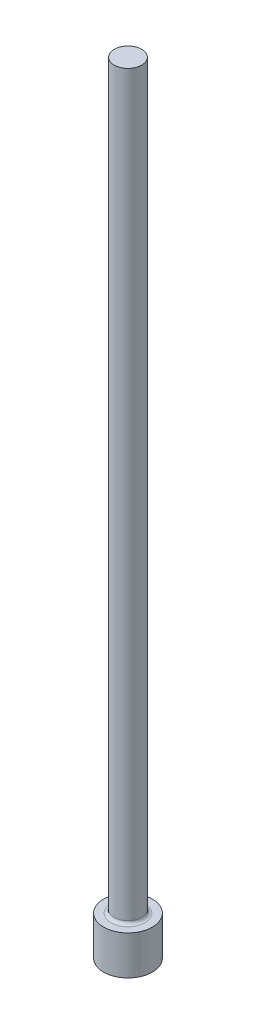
ISO-10303-21;
HEADER;
FILE_DESCRIPTION(('STEP AP214'),'2;1');
FILE_NAME('part.step','',(''),(''),'','','');
FILE_SCHEMA(('AUTOMOTIVE_DESIGN { 1 0 10303 214 1 1 1 1 }'));
ENDSEC;
DATA;
#1=APPLICATION_CONTEXT('core data for automotive mechanical design processes');
#2=APPLICATION_PROTOCOL_DEFINITION('international standard','automotive_design',2000,#1);
#3=PRODUCT_CONTEXT('',#1,'mechanical');
#4=PRODUCT('Part','Part','',(#3));
#5=PRODUCT_RELATED_PRODUCT_CATEGORY('part','',(#4));
#6=PRODUCT_DEFINITION_FORMATION('','',#4);
#7=PRODUCT_DEFINITION_CONTEXT('part definition',#1,'design');
#8=PRODUCT_DEFINITION('design','',#6,#7);
#9=PRODUCT_DEFINITION_SHAPE('','',#8);
#10=(LENGTH_UNIT() NAMED_UNIT(*) SI_UNIT(.MILLI.,.METRE.));
#11=(NAMED_UNIT(*) PLANE_ANGLE_UNIT() SI_UNIT($,.RADIAN.));
#12=(NAMED_UNIT(*) SI_UNIT($,.STERADIAN.) SOLID_ANGLE_UNIT());
#13=UNCERTAINTY_MEASURE_WITH_UNIT(LENGTH_MEASURE(1.E-05),#10,'distance_accuracy_value','');
#14=(GEOMETRIC_REPRESENTATION_CONTEXT(3) GLOBAL_UNCERTAINTY_ASSIGNED_CONTEXT((#13)) GLOBAL_UNIT_ASSIGNED_CONTEXT((#10,
#11,#12)) REPRESENTATION_CONTEXT('',''));
#15=CARTESIAN_POINT('',(0.,0.,0.));
#16=DIRECTION('',(0.,0.,1.));
#17=DIRECTION('',(1.,0.,0.));
#18=AXIS2_PLACEMENT_3D('',#15,#16,#17);
#19=CARTESIAN_POINT('',(0.,63.5,0.));
#20=DIRECTION('',(0.,-1.,0.));
#21=DIRECTION('',(0.,0.,-1.));
#22=AXIS2_PLACEMENT_3D('',#19,#20,#21);
#23=PLANE('',#22);
#24=CARTESIAN_POINT('',(0.,63.5,0.));
#25=DIRECTION('',(0.,1.,0.));
#26=DIRECTION('',(0.,0.,1.));
#27=AXIS2_PLACEMENT_3D('',#24,#25,#26);
#28=CIRCLE('',#27,1.1176);
#29=CARTESIAN_POINT('',(0.,63.5,1.1176));
#30=VERTEX_POINT('',#29);
#31=EDGE_CURVE('E10',#30,#30,#28,.T.);
#32=ORIENTED_EDGE('',*,*,#31,.T.);
#33=EDGE_LOOP('',(#32));
#34=FACE_BOUND('',#33,.T.);
#35=ADVANCED_FACE('F30',(#34),#23,.F.);
#36=CARTESIAN_POINT('',(0.,0.,0.));
#37=DIRECTION('',(0.,1.,0.));
#38=DIRECTION('',(0.,0.,1.));
#39=AXIS2_PLACEMENT_3D('',#36,#37,#38);
#40=CYLINDRICAL_SURFACE('',#39,1.1176);
#41=ORIENTED_EDGE('',*,*,#31,.F.);
#42=EDGE_LOOP('',(#41));
#43=FACE_BOUND('',#42,.T.);
#44=CARTESIAN_POINT('',(0.,3.429,0.));
#45=DIRECTION('',(0.,1.,0.));
#46=DIRECTION('',(0.,0.,1.));
#47=AXIS2_PLACEMENT_3D('',#44,#45,#46);
#48=CIRCLE('',#47,1.1176);
#49=CARTESIAN_POINT('',(0.,3.429,1.1176));
#50=VERTEX_POINT('',#49);
#51=EDGE_CURVE('E36',#50,#50,#48,.T.);
#52=ORIENTED_EDGE('',*,*,#51,.T.);
#53=EDGE_LOOP('',(#52));
#54=FACE_BOUND('',#53,.T.);
#55=ADVANCED_FACE('F65',(#43,#54),#40,.T.);
#56=CARTESIAN_POINT('',(0.,3.429,0.));
#57=DIRECTION('',(0.,1.,0.));
#58=DIRECTION('',(0.,0.,1.));
#59=AXIS2_PLACEMENT_3D('',#56,#57,#58);
#60=TOROIDAL_SURFACE('',#59,1.3716,0.254);
#61=ORIENTED_EDGE('',*,*,#51,.F.);
#62=EDGE_LOOP('',(#61));
#63=FACE_BOUND('',#62,.T.);
#64=CARTESIAN_POINT('',(0.,3.175,0.));
#65=DIRECTION('',(0.,1.,0.));
#66=DIRECTION('',(0.,0.,1.));
#67=AXIS2_PLACEMENT_3D('',#64,#65,#66);
#68=CIRCLE('',#67,1.3716);
#69=CARTESIAN_POINT('',(0.,3.175,1.3716));
#70=VERTEX_POINT('',#69);
#71=EDGE_CURVE('E40',#70,#70,#68,.T.);
#72=ORIENTED_EDGE('',*,*,#71,.T.);
#73=EDGE_LOOP('',(#72));
#74=FACE_BOUND('',#73,.T.);
#75=ADVANCED_FACE('F69',(#63,#74),#60,.F.);
#76=CARTESIAN_POINT('',(1.9812,3.175,0.));
#77=DIRECTION('',(0.,-1.,0.));
#78=DIRECTION('',(0.,0.,-1.));
#79=AXIS2_PLACEMENT_3D('',#76,#77,#78);
#80=PLANE('',#79);
#81=ORIENTED_EDGE('',*,*,#71,.F.);
#82=EDGE_LOOP('',(#81));
#83=FACE_BOUND('',#82,.T.);
#84=CARTESIAN_POINT('',(0.,3.175,0.));
#85=DIRECTION('',(0.,1.,0.));
#86=DIRECTION('',(0.,0.,1.));
#87=AXIS2_PLACEMENT_3D('',#84,#85,#86);
#88=CIRCLE('',#87,1.9812);
#89=CARTESIAN_POINT('',(0.,3.175,1.9812));
#90=VERTEX_POINT('',#89);
#91=EDGE_CURVE('E44',#90,#90,#88,.T.);
#92=ORIENTED_EDGE('',*,*,#91,.T.);
#93=EDGE_LOOP('',(#92));
#94=FACE_BOUND('',#93,.T.);
#95=ADVANCED_FACE('F61',(#83,#94),#80,.F.);
#96=CARTESIAN_POINT('',(0.,0.,0.));
#97=DIRECTION('',(0.,1.,0.));
#98=DIRECTION('',(0.,0.,1.));
#99=AXIS2_PLACEMENT_3D('',#96,#97,#98);
#100=CYLINDRICAL_SURFACE('',#99,1.9812);
#101=ORIENTED_EDGE('',*,*,#91,.F.);
#102=EDGE_LOOP('',(#101));
#103=FACE_BOUND('',#102,.T.);
#104=CARTESIAN_POINT('',(0.,0.,0.));
#105=DIRECTION('',(0.,1.,0.));
#106=DIRECTION('',(0.,0.,1.));
#107=AXIS2_PLACEMENT_3D('',#104,#105,#106);
#108=CIRCLE('',#107,1.9812);
#109=CARTESIAN_POINT('',(0.,0.,1.9812));
#110=VERTEX_POINT('',#109);
#111=EDGE_CURVE('E49',#110,#110,#108,.T.);
#112=ORIENTED_EDGE('',*,*,#111,.T.);
#113=EDGE_LOOP('',(#112));
#114=FACE_BOUND('',#113,.T.);
#115=ADVANCED_FACE('F53',(#103,#114),#100,.T.);
#116=CARTESIAN_POINT('',(0.,0.,0.));
#117=DIRECTION('',(0.,1.,0.));
#118=DIRECTION('',(0.,0.,1.));
#119=AXIS2_PLACEMENT_3D('',#116,#117,#118);
#120=PLANE('',#119);
#121=ORIENTED_EDGE('',*,*,#111,.F.);
#122=EDGE_LOOP('',(#121));
#123=FACE_BOUND('',#122,.T.);
#124=ADVANCED_FACE('F55',(#123),#120,.F.);
#125=CLOSED_SHELL('',(#35,#55,#75,#95,#115,#124));
#126=MANIFOLD_SOLID_BREP('B2',#125);
#127=ADVANCED_BREP_SHAPE_REPRESENTATION('',(#18,#126),#14);
#128=SHAPE_DEFINITION_REPRESENTATION(#9,#127);
ENDSEC;
END-ISO-10303-21;
